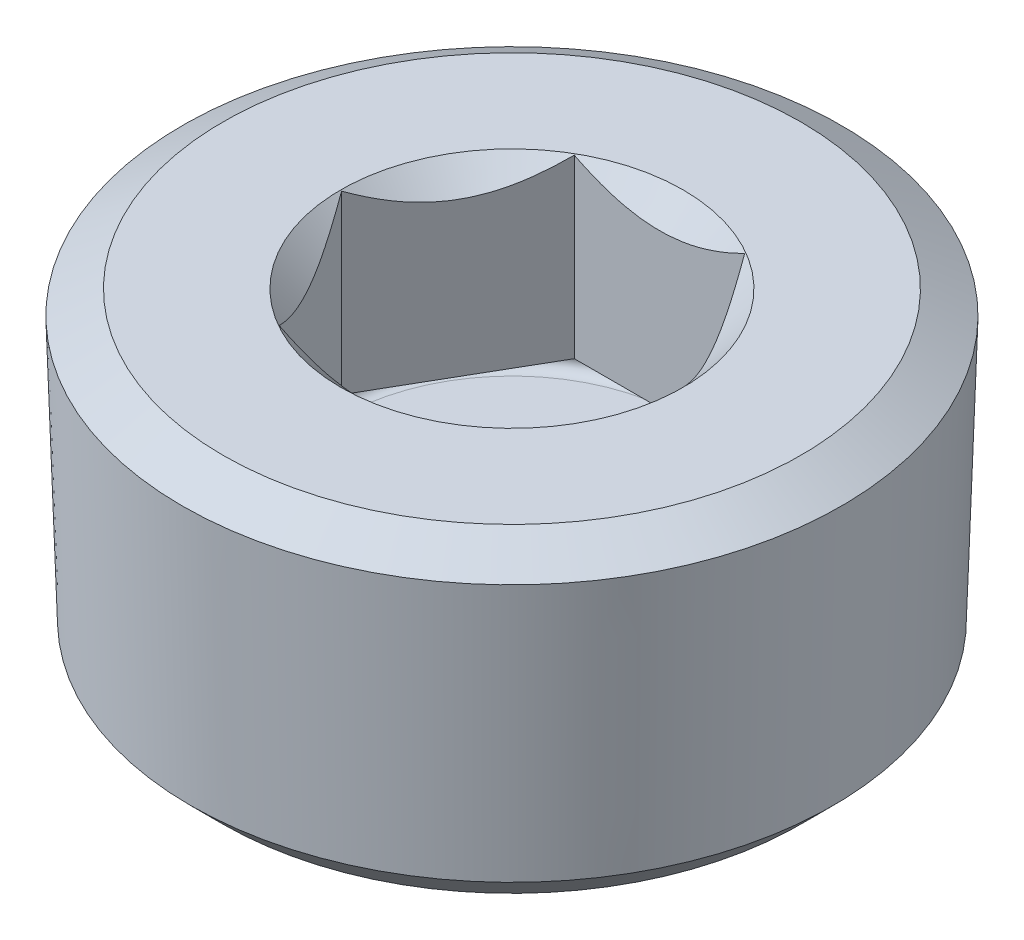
ISO-10303-21;
HEADER;
FILE_DESCRIPTION(('STEP AP214'),'2;1');
FILE_NAME('part.step','',(''),(''),'','','');
FILE_SCHEMA(('AUTOMOTIVE_DESIGN { 1 0 10303 214 1 1 1 1 }'));
ENDSEC;
DATA;
#1=APPLICATION_CONTEXT('core data for automotive mechanical design processes');
#2=APPLICATION_PROTOCOL_DEFINITION('international standard','automotive_design',2000,#1);
#3=PRODUCT_CONTEXT('',#1,'mechanical');
#4=PRODUCT('Part','Part','',(#3));
#5=PRODUCT_RELATED_PRODUCT_CATEGORY('part','',(#4));
#6=PRODUCT_DEFINITION_FORMATION('','',#4);
#7=PRODUCT_DEFINITION_CONTEXT('part definition',#1,'design');
#8=PRODUCT_DEFINITION('design','',#6,#7);
#9=PRODUCT_DEFINITION_SHAPE('','',#8);
#10=(LENGTH_UNIT() NAMED_UNIT(*) SI_UNIT(.MILLI.,.METRE.));
#11=(NAMED_UNIT(*) PLANE_ANGLE_UNIT() SI_UNIT($,.RADIAN.));
#12=(NAMED_UNIT(*) SI_UNIT($,.STERADIAN.) SOLID_ANGLE_UNIT());
#13=UNCERTAINTY_MEASURE_WITH_UNIT(LENGTH_MEASURE(1.E-05),#10,'distance_accuracy_value','');
#14=(GEOMETRIC_REPRESENTATION_CONTEXT(3) GLOBAL_UNCERTAINTY_ASSIGNED_CONTEXT((#13)) GLOBAL_UNIT_ASSIGNED_CONTEXT((#10,
#11,#12)) REPRESENTATION_CONTEXT('',''));
#15=CARTESIAN_POINT('',(0.,0.,0.));
#16=DIRECTION('',(0.,0.,1.));
#17=DIRECTION('',(1.,0.,0.));
#18=AXIS2_PLACEMENT_3D('',#15,#16,#17);
#19=CARTESIAN_POINT('',(0.,0.,0.));
#20=DIRECTION('',(0.,1.,0.));
#21=DIRECTION('',(0.,0.,1.));
#22=AXIS2_PLACEMENT_3D('',#19,#20,#21);
#23=PLANE('',#22);
#24=CARTESIAN_POINT('',(0.,0.,0.));
#25=DIRECTION('',(0.,1.,0.));
#26=DIRECTION('',(0.,0.,1.));
#27=AXIS2_PLACEMENT_3D('',#24,#25,#26);
#28=CIRCLE('',#27,11.049);
#29=CARTESIAN_POINT('',(0.,0.,11.049));
#30=VERTEX_POINT('',#29);
#31=EDGE_CURVE('E210',#30,#30,#28,.T.);
#32=ORIENTED_EDGE('',*,*,#31,.F.);
#33=EDGE_LOOP('',(#32));
#34=FACE_BOUND('',#33,.T.);
#35=CARTESIAN_POINT('',(0.,0.,0.));
#36=DIRECTION('',(0.,1.,0.));
#37=DIRECTION('',(0.,0.,1.));
#38=AXIS2_PLACEMENT_3D('',#35,#36,#37);
#39=CIRCLE('',#38,18.6474634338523);
#40=CARTESIAN_POINT('',(0.,0.,18.6474634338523));
#41=VERTEX_POINT('',#40);
#42=EDGE_CURVE('E96',#41,#41,#39,.T.);
#43=ORIENTED_EDGE('',*,*,#42,.T.);
#44=EDGE_LOOP('',(#43));
#45=FACE_BOUND('',#44,.T.);
#46=ADVANCED_FACE('F34',(#34,#45),#23,.T.);
#47=CARTESIAN_POINT('',(0.,0.,0.));
#48=DIRECTION('',(0.,-1.,0.));
#49=DIRECTION('',(0.,0.,-1.));
#50=AXIS2_PLACEMENT_3D('',#47,#48,#49);
#51=CONICAL_SURFACE('',#50,18.6474634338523,1.0471975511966);
#52=CARTESIAN_POINT('',(0.,-1.51754437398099,0.));
#53=DIRECTION('',(0.,1.,0.));
#54=DIRECTION('',(0.,0.,1.));
#55=AXIS2_PLACEMENT_3D('',#52,#53,#54);
#56=CIRCLE('',#55,21.2759273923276);
#57=CARTESIAN_POINT('',(0.,-1.51754437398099,21.2759273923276));
#58=VERTEX_POINT('',#57);
#59=EDGE_CURVE('E214',#58,#58,#56,.T.);
#60=ORIENTED_EDGE('',*,*,#59,.T.);
#61=EDGE_LOOP('',(#60));
#62=FACE_BOUND('',#61,.T.);
#63=ORIENTED_EDGE('',*,*,#42,.F.);
#64=EDGE_LOOP('',(#63));
#65=FACE_BOUND('',#64,.T.);
#66=ADVANCED_FACE('F200',(#62,#65),#51,.T.);
#67=CARTESIAN_POINT('',(0.,-1.51754437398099,0.));
#68=DIRECTION('',(0.,1.,0.));
#69=DIRECTION('',(0.,0.,1.));
#70=AXIS2_PLACEMENT_3D('',#67,#68,#69);
#71=CONICAL_SURFACE('',#70,21.2759273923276,0.0312064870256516);
#72=CARTESIAN_POINT('',(0.,-18.5273238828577,0.));
#73=DIRECTION('',(0.,1.,0.));
#74=DIRECTION('',(0.,0.,1.));
#75=AXIS2_PLACEMENT_3D('',#72,#73,#74);
#76=CIRCLE('',#75,20.7449395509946);
#77=CARTESIAN_POINT('',(0.,-18.5273238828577,20.7449395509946));
#78=VERTEX_POINT('',#77);
#79=EDGE_CURVE('E217',#78,#78,#76,.T.);
#80=ORIENTED_EDGE('',*,*,#79,.T.);
#81=EDGE_LOOP('',(#80));
#82=FACE_BOUND('',#81,.T.);
#83=ORIENTED_EDGE('',*,*,#59,.F.);
#84=EDGE_LOOP('',(#83));
#85=FACE_BOUND('',#84,.T.);
#86=ADVANCED_FACE('F205',(#82,#85),#71,.T.);
#87=CARTESIAN_POINT('',(0.,-18.5273238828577,0.));
#88=DIRECTION('',(0.,1.,0.));
#89=DIRECTION('',(0.,0.,1.));
#90=AXIS2_PLACEMENT_3D('',#87,#88,#89);
#91=CONICAL_SURFACE('',#90,20.7449395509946,0.785398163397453);
#92=CARTESIAN_POINT('',(0.,-20.6248,0.));
#93=DIRECTION('',(0.,1.,0.));
#94=DIRECTION('',(0.,0.,1.));
#95=AXIS2_PLACEMENT_3D('',#92,#93,#94);
#96=CIRCLE('',#95,18.6474634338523);
#97=CARTESIAN_POINT('',(0.,-20.6248,18.6474634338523));
#98=VERTEX_POINT('',#97);
#99=EDGE_CURVE('E222',#98,#98,#96,.T.);
#100=ORIENTED_EDGE('',*,*,#99,.T.);
#101=EDGE_LOOP('',(#100));
#102=FACE_BOUND('',#101,.T.);
#103=ORIENTED_EDGE('',*,*,#79,.F.);
#104=EDGE_LOOP('',(#103));
#105=FACE_BOUND('',#104,.T.);
#106=ADVANCED_FACE('F305',(#102,#105),#91,.T.);
#107=CARTESIAN_POINT('',(-18.6474634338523,-20.6248,0.));
#108=DIRECTION('',(0.,-1.,0.));
#109=DIRECTION('',(0.,0.,-1.));
#110=AXIS2_PLACEMENT_3D('',#107,#108,#109);
#111=PLANE('',#110);
#112=ORIENTED_EDGE('',*,*,#99,.F.);
#113=EDGE_LOOP('',(#112));
#114=FACE_BOUND('',#113,.T.);
#115=ADVANCED_FACE('F149',(#114),#111,.T.);
#116=CARTESIAN_POINT('',(0.,0.,0.));
#117=DIRECTION('',(0.,1.,0.));
#118=DIRECTION('',(0.,0.,1.));
#119=AXIS2_PLACEMENT_3D('',#116,#117,#118);
#120=CONICAL_SURFACE('',#119,11.049,0.785398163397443);
#121=CARTESIAN_POINT('',(-11.49689211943,3.88097499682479,9.525));
#122=CARTESIAN_POINT('',(-11.2192109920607,3.66719342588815,9.525));
#123=CARTESIAN_POINT('',(-10.9400359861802,3.45532180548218,9.525));
#124=CARTESIAN_POINT('',(-10.3780867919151,3.03627173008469,9.525));
#125=CARTESIAN_POINT('',(-10.0953117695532,2.82909439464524,9.525));
#126=CARTESIAN_POINT('',(-9.5234849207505,2.41883185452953,9.525));
#127=CARTESIAN_POINT('',(-9.23440150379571,2.21579053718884,9.525));
#128=CARTESIAN_POINT('',(-8.65142747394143,1.81675439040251,9.525));
#129=CARTESIAN_POINT('',(-8.35753719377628,1.620759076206,9.525));
#130=CARTESIAN_POINT('',(-7.74525046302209,1.22521931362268,9.525));
#131=CARTESIAN_POINT('',(-7.42648498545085,1.02624324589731,9.525));
#132=CARTESIAN_POINT('',(-6.78146699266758,0.640613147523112,9.525));
#133=CARTESIAN_POINT('',(-6.45521322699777,0.453961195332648,9.525));
#134=CARTESIAN_POINT('',(-5.79512470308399,0.096952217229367,9.525));
#135=CARTESIAN_POINT('',(-5.46131601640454,-0.0734526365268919,9.525));
#136=CARTESIAN_POINT('',(-4.78424953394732,-0.394149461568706,9.525));
#137=CARTESIAN_POINT('',(-4.44099629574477,-0.544450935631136,9.525));
#138=CARTESIAN_POINT('',(-3.77889720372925,-0.805823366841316,9.525));
#139=CARTESIAN_POINT('',(-3.46101405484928,-0.91930823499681,9.525));
#140=CARTESIAN_POINT('',(-2.81713163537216,-1.12083511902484,9.525));
#141=CARTESIAN_POINT('',(-2.49113185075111,-1.20887551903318,9.525));
#142=CARTESIAN_POINT('',(-1.83865140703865,-1.35327332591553,9.525));
#143=CARTESIAN_POINT('',(-1.51230057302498,-1.41020749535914,9.525));
#144=CARTESIAN_POINT('',(-0.855522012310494,-1.49120208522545,9.525));
#145=CARTESIAN_POINT('',(-0.525095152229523,-1.51526937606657,9.525));
#146=CARTESIAN_POINT('',(0.121903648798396,-1.52846981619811,9.525));
#147=CARTESIAN_POINT('',(0.438445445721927,-1.51909358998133,9.525));
#148=CARTESIAN_POINT('',(1.06906801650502,-1.46935129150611,9.525));
#149=CARTESIAN_POINT('',(1.3831485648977,-1.42898241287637,9.525));
#150=CARTESIAN_POINT('',(2.01189915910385,-1.31885442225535,9.525));
#151=CARTESIAN_POINT('',(2.3264766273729,-1.24857566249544,9.525));
#152=CARTESIAN_POINT('',(2.94870072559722,-1.08253292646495,9.525));
#153=CARTESIAN_POINT('',(3.25634774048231,-0.986770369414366,9.525));
#154=CARTESIAN_POINT('',(3.88126120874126,-0.767982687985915,9.525));
#155=CARTESIAN_POINT('',(4.19809084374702,-0.643724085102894,9.525));
#156=CARTESIAN_POINT('',(4.82360317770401,-0.376005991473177,9.525));
#157=CARTESIAN_POINT('',(5.13228213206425,-0.232537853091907,9.525));
#158=CARTESIAN_POINT('',(5.74294917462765,0.0701972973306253,9.525));
#159=CARTESIAN_POINT('',(6.04491295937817,0.229512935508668,9.525));
#160=CARTESIAN_POINT('',(6.64192212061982,0.560437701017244,9.525));
#161=CARTESIAN_POINT('',(6.93696855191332,0.732044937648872,9.525));
#162=CARTESIAN_POINT('',(7.50662944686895,1.07643721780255,9.525));
#163=CARTESIAN_POINT('',(7.78153348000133,1.2487458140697,9.525));
#164=CARTESIAN_POINT('',(8.32661839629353,1.60070008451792,9.525));
#165=CARTESIAN_POINT('',(8.59679892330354,1.78034630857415,9.525));
#166=CARTESIAN_POINT('',(9.13088323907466,2.14420570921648,9.525));
#167=CARTESIAN_POINT('',(9.3948200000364,2.32837066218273,9.525));
#168=CARTESIAN_POINT('',(9.91907224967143,2.70163946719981,9.525));
#169=CARTESIAN_POINT('',(10.1793887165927,2.89074194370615,9.525));
#170=CARTESIAN_POINT('',(10.4381864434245,3.08186555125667,9.525));
#171=B_SPLINE_CURVE_WITH_KNOTS('',3,(#121,#122,#123,#124,#125,#126,#127,#128,#129,#130,#131,
#132,#133,#134,#135,#136,#137,#138,#139,#140,#141,#142,#143,#144,#145,#146,#147,#148,#149,#150,
#151,#152,#153,#154,#155,#156,#157,#158,#159,#160,#161,#162,#163,#164,#165,#166,#167,#168,#169,
#170),.UNSPECIFIED.,.F.,.F.,(4,2,2,2,2,2,2,2,2,2,2,2,2,2,2,2,2,2,2,2,2,2,2,2,4),(0.,
1.05134425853,2.10293667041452,3.16263996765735,4.22227021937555,5.34935795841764,
6.47663529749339,7.60048450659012,8.72380058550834,9.73552741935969,10.7473184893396,
11.7396508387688,12.7317757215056,13.6802435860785,14.6287973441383,15.5945508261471,
16.5602505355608,17.5804442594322,18.6010988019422,19.6249878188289,20.6487196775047,
21.6219085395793,22.5951704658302,23.5606213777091,24.5258061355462),.UNSPECIFIED.);
#172=CARTESIAN_POINT('',(5.49926131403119,-0.0504773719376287,9.525));
#173=VERTEX_POINT('',#172);
#174=CARTESIAN_POINT('',(-5.49926131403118,-0.0504773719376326,9.525));
#175=VERTEX_POINT('',#174);
#176=EDGE_CURVE('E48',#173,#175,#171,.F.);
#177=ORIENTED_EDGE('',*,*,#176,.T.);
#178=CARTESIAN_POINT('',(-5.49914584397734,-0.0503619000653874,9.5252));
#179=CARTESIAN_POINT('',(-5.59369092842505,-0.144893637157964,9.36144311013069));
#180=CARTESIAN_POINT('',(-5.6889764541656,-0.236540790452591,9.19640373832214));
#181=CARTESIAN_POINT('',(-5.88114364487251,-0.413149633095,8.86356040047));
#182=CARTESIAN_POINT('',(-5.97802614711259,-0.498107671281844,8.69575498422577));
#183=CARTESIAN_POINT('',(-6.17395951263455,-0.66078179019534,8.35638844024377));
#184=CARTESIAN_POINT('',(-6.27301961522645,-0.738453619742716,8.18481130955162));
#185=CARTESIAN_POINT('',(-6.47276685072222,-0.88486835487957,7.83883894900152));
#186=CARTESIAN_POINT('',(-6.57345373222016,-0.953612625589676,7.66444415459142));
#187=CARTESIAN_POINT('',(-6.77483563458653,-1.07999715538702,7.31564046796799));
#188=CARTESIAN_POINT('',(-6.87550590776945,-1.13779424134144,7.14127444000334));
#189=CARTESIAN_POINT('',(-7.07825767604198,-1.24243057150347,6.79009807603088));
#190=CARTESIAN_POINT('',(-7.18033901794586,-1.28927099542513,6.61328800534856));
#191=CARTESIAN_POINT('',(-7.38547629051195,-1.37081474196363,6.25797982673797));
#192=CARTESIAN_POINT('',(-7.48852948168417,-1.40554538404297,6.07948646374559));
#193=CARTESIAN_POINT('',(-7.69550102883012,-1.46210640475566,5.72100122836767));
#194=CARTESIAN_POINT('',(-7.79941925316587,-1.48393871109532,5.5410095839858));
#195=CARTESIAN_POINT('',(-8.05265883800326,-1.5205452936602,5.1023857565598));
#196=CARTESIAN_POINT('',(-8.20225391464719,-1.52822719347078,4.84327948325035));
#197=CARTESIAN_POINT('',(-8.50117351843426,-1.51533350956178,4.32553554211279));
#198=CARTESIAN_POINT('',(-8.65049793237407,-1.49474802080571,4.06689807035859));
#199=CARTESIAN_POINT('',(-8.94773915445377,-1.42653463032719,3.55206117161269));
#200=CARTESIAN_POINT('',(-9.09565420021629,-1.37887648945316,3.29586479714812));
#201=CARTESIAN_POINT('',(-9.38894191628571,-1.25910833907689,2.78787557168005));
#202=CARTESIAN_POINT('',(-9.53431478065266,-1.18700020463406,2.53608238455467));
#203=CARTESIAN_POINT('',(-9.79237138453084,-1.03865549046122,2.08911523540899));
#204=CARTESIAN_POINT('',(-9.9056266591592,-0.966321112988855,1.89295134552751));
#205=CARTESIAN_POINT('',(-10.1301042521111,-0.809996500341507,1.504144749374));
#206=CARTESIAN_POINT('',(-10.2413265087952,-0.726005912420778,1.31150214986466));
#207=CARTESIAN_POINT('',(-10.4613877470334,-0.548251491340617,0.930344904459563));
#208=CARTESIAN_POINT('',(-10.5702329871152,-0.454518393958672,0.74181941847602));
#209=CARTESIAN_POINT('',(-10.7859080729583,-0.258509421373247,0.368259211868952));
#210=CARTESIAN_POINT('',(-10.8927391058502,-0.156238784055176,0.183222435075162));
#211=CARTESIAN_POINT('',(-10.9986380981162,-0.0503619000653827,-0.000199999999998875));
#212=B_SPLINE_CURVE_WITH_KNOTS('',3,(#178,#179,#180,#181,#182,#183,#184,#185,#186,#187,#188,
#189,#190,#191,#192,#193,#194,#195,#196,#197,#198,#199,#200,#201,#202,#203,#204,#205,#206,#207,
#208,#209,#210,#211),.UNSPECIFIED.,.F.,.F.,(4,2,2,2,2,2,2,2,2,2,2,2,2,2,2,2,4),(0.,
0.634236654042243,1.26881713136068,1.9070310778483,2.54514731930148,3.17328515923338,
3.80135533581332,4.42799928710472,5.0545495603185,5.95101645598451,6.84779755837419,
7.74558230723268,8.64329822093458,9.35630333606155,10.0693300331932,10.7801718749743,
11.4905807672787),.UNSPECIFIED.);
#213=CARTESIAN_POINT('',(-10.9985226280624,-0.0504773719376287,0.));
#214=VERTEX_POINT('',#213);
#215=EDGE_CURVE('E102',#175,#214,#212,.T.);
#216=ORIENTED_EDGE('',*,*,#215,.T.);
#217=CARTESIAN_POINT('',(-10.9986380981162,-0.0503619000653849,0.000200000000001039));
#218=CARTESIAN_POINT('',(-10.9040930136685,-0.144893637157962,-0.16355688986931));
#219=CARTESIAN_POINT('',(-10.808807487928,-0.236540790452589,-0.328596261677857));
#220=CARTESIAN_POINT('',(-10.616640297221,-0.413149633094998,-0.661439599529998));
#221=CARTESIAN_POINT('',(-10.519757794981,-0.498107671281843,-0.829245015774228));
#222=CARTESIAN_POINT('',(-10.323824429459,-0.660781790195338,-1.16861155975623));
#223=CARTESIAN_POINT('',(-10.2247643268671,-0.738453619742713,-1.34018869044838));
#224=CARTESIAN_POINT('',(-10.0250170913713,-0.884868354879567,-1.68616105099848));
#225=CARTESIAN_POINT('',(-9.92433020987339,-0.953612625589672,-1.86055584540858));
#226=CARTESIAN_POINT('',(-9.72294830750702,-1.07999715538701,-2.20935953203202));
#227=CARTESIAN_POINT('',(-9.62227803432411,-1.13779424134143,-2.38372555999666));
#228=CARTESIAN_POINT('',(-9.41952626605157,-1.24243057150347,-2.73490192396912));
#229=CARTESIAN_POINT('',(-9.3174449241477,-1.28927099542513,-2.91171199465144));
#230=CARTESIAN_POINT('',(-9.1123076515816,-1.37081474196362,-3.26702017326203));
#231=CARTESIAN_POINT('',(-9.00925446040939,-1.40554538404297,-3.44551353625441));
#232=CARTESIAN_POINT('',(-8.80228291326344,-1.46210640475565,-3.80399877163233));
#233=CARTESIAN_POINT('',(-8.69836468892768,-1.48393871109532,-3.98399041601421));
#234=CARTESIAN_POINT('',(-8.4451251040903,-1.52054529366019,-4.42261424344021));
#235=CARTESIAN_POINT('',(-8.29553002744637,-1.52822719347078,-4.68172051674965));
#236=CARTESIAN_POINT('',(-7.9966104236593,-1.51533350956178,-5.19946445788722));
#237=CARTESIAN_POINT('',(-7.84728600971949,-1.4947480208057,-5.45810192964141));
#238=CARTESIAN_POINT('',(-7.55004478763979,-1.42653463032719,-5.97293882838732));
#239=CARTESIAN_POINT('',(-7.40212974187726,-1.37887648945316,-6.22913520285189));
#240=CARTESIAN_POINT('',(-7.10884202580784,-1.25910833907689,-6.73712442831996));
#241=CARTESIAN_POINT('',(-6.96346916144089,-1.18700020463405,-6.98891761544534));
#242=CARTESIAN_POINT('',(-6.70541255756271,-1.03865549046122,-7.43588476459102));
#243=CARTESIAN_POINT('',(-6.59215728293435,-0.966321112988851,-7.6320486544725));
#244=CARTESIAN_POINT('',(-6.36767968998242,-0.809996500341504,-8.02085525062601));
#245=CARTESIAN_POINT('',(-6.25645743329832,-0.726005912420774,-8.21349785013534));
#246=CARTESIAN_POINT('',(-6.03639619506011,-0.548251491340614,-8.59465509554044));
#247=CARTESIAN_POINT('',(-5.92755095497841,-0.454518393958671,-8.78318058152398));
#248=CARTESIAN_POINT('',(-5.71187586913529,-0.258509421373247,-9.15674078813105));
#249=CARTESIAN_POINT('',(-5.60504483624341,-0.156238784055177,-9.34177756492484));
#250=CARTESIAN_POINT('',(-5.49914584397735,-0.0503619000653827,-9.5252));
#251=B_SPLINE_CURVE_WITH_KNOTS('',3,(#217,#218,#219,#220,#221,#222,#223,#224,#225,#226,#227,
#228,#229,#230,#231,#232,#233,#234,#235,#236,#237,#238,#239,#240,#241,#242,#243,#244,#245,#246,
#247,#248,#249,#250),.UNSPECIFIED.,.F.,.F.,(4,2,2,2,2,2,2,2,2,2,2,2,2,2,2,2,4),(0.,
0.634236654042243,1.26881713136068,1.9070310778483,2.54514731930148,3.17328515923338,
3.80135533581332,4.42799928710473,5.0545495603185,5.95101645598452,6.84779755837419,
7.74558230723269,8.64329822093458,9.35630333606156,10.0693300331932,10.7801718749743,
11.4905807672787),.UNSPECIFIED.);
#252=CARTESIAN_POINT('',(-5.49926131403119,-0.0504773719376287,-9.525));
#253=VERTEX_POINT('',#252);
#254=EDGE_CURVE('E172',#214,#253,#251,.T.);
#255=ORIENTED_EDGE('',*,*,#254,.T.);
#256=CARTESIAN_POINT('',(-11.49689211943,3.8809749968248,-9.525));
#257=CARTESIAN_POINT('',(-11.2192109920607,3.66719342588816,-9.525));
#258=CARTESIAN_POINT('',(-10.9400359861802,3.45532180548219,-9.525));
#259=CARTESIAN_POINT('',(-10.3780867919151,3.0362717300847,-9.525));
#260=CARTESIAN_POINT('',(-10.0953117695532,2.82909439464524,-9.525));
#261=CARTESIAN_POINT('',(-9.52348492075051,2.41883185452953,-9.525));
#262=CARTESIAN_POINT('',(-9.23440150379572,2.21579053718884,-9.525));
#263=CARTESIAN_POINT('',(-8.65142747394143,1.81675439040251,-9.525));
#264=CARTESIAN_POINT('',(-8.35753719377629,1.620759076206,-9.525));
#265=CARTESIAN_POINT('',(-7.7452504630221,1.22521931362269,-9.525));
#266=CARTESIAN_POINT('',(-7.42648498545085,1.02624324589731,-9.525));
#267=CARTESIAN_POINT('',(-6.78146699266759,0.640613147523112,-9.525));
#268=CARTESIAN_POINT('',(-6.45521322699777,0.453961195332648,-9.525));
#269=CARTESIAN_POINT('',(-5.79512470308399,0.0969522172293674,-9.525));
#270=CARTESIAN_POINT('',(-5.46131601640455,-0.0734526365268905,-9.525));
#271=CARTESIAN_POINT('',(-4.78424953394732,-0.394149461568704,-9.525));
#272=CARTESIAN_POINT('',(-4.44099629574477,-0.544450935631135,-9.525));
#273=CARTESIAN_POINT('',(-3.77889720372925,-0.805823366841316,-9.525));
#274=CARTESIAN_POINT('',(-3.46101405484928,-0.919308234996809,-9.525));
#275=CARTESIAN_POINT('',(-2.81713163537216,-1.12083511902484,-9.525));
#276=CARTESIAN_POINT('',(-2.49113185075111,-1.20887551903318,-9.525));
#277=CARTESIAN_POINT('',(-1.83865140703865,-1.35327332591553,-9.525));
#278=CARTESIAN_POINT('',(-1.51230057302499,-1.41020749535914,-9.525));
#279=CARTESIAN_POINT('',(-0.855522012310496,-1.49120208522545,-9.525));
#280=CARTESIAN_POINT('',(-0.525095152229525,-1.51526937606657,-9.525));
#281=CARTESIAN_POINT('',(0.121903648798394,-1.52846981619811,-9.525));
#282=CARTESIAN_POINT('',(0.438445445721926,-1.51909358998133,-9.525));
#283=CARTESIAN_POINT('',(1.06906801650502,-1.46935129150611,-9.525));
#284=CARTESIAN_POINT('',(1.3831485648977,-1.42898241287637,-9.525));
#285=CARTESIAN_POINT('',(2.01189915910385,-1.31885442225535,-9.525));
#286=CARTESIAN_POINT('',(2.3264766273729,-1.24857566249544,-9.525));
#287=CARTESIAN_POINT('',(2.94870072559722,-1.08253292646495,-9.525));
#288=CARTESIAN_POINT('',(3.25634774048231,-0.986770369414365,-9.525));
#289=CARTESIAN_POINT('',(3.88126120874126,-0.767982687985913,-9.525));
#290=CARTESIAN_POINT('',(4.19809084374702,-0.643724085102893,-9.525));
#291=CARTESIAN_POINT('',(4.823603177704,-0.376005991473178,-9.525));
#292=CARTESIAN_POINT('',(5.13228213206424,-0.232537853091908,-9.525));
#293=CARTESIAN_POINT('',(5.74294917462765,0.0701972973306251,-9.525));
#294=CARTESIAN_POINT('',(6.04491295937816,0.229512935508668,-9.525));
#295=CARTESIAN_POINT('',(6.64192212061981,0.560437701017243,-9.525));
#296=CARTESIAN_POINT('',(6.93696855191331,0.73204493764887,-9.525));
#297=CARTESIAN_POINT('',(7.50662944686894,1.07643721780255,-9.525));
#298=CARTESIAN_POINT('',(7.78153348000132,1.24874581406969,-9.525));
#299=CARTESIAN_POINT('',(8.32661839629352,1.60070008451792,-9.525));
#300=CARTESIAN_POINT('',(8.59679892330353,1.78034630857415,-9.525));
#301=CARTESIAN_POINT('',(9.13088323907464,2.14420570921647,-9.525));
#302=CARTESIAN_POINT('',(9.39482000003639,2.32837066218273,-9.525));
#303=CARTESIAN_POINT('',(9.91907224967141,2.7016394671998,-9.525));
#304=CARTESIAN_POINT('',(10.1793887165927,2.89074194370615,-9.525));
#305=CARTESIAN_POINT('',(10.4381864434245,3.08186555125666,-9.525));
#306=B_SPLINE_CURVE_WITH_KNOTS('',3,(#256,#257,#258,#259,#260,#261,#262,#263,#264,#265,#266,
#267,#268,#269,#270,#271,#272,#273,#274,#275,#276,#277,#278,#279,#280,#281,#282,#283,#284,#285,
#286,#287,#288,#289,#290,#291,#292,#293,#294,#295,#296,#297,#298,#299,#300,#301,#302,#303,#304,
#305),.UNSPECIFIED.,.F.,.F.,(4,2,2,2,2,2,2,2,2,2,2,2,2,2,2,2,2,2,2,2,2,2,2,2,4),(0.,
1.05134425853,2.10293667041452,3.16263996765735,4.22227021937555,5.34935795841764,
6.4766352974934,7.60048450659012,8.72380058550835,9.7355274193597,10.7473184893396,
11.7396508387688,12.7317757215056,13.6802435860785,14.6287973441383,15.5945508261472,
16.5602505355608,17.5804442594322,18.6010988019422,19.6249878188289,20.6487196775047,
21.6219085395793,22.5951704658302,23.5606213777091,24.5258061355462),.UNSPECIFIED.);
#307=CARTESIAN_POINT('',(5.49926131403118,-0.0504773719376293,-9.525));
#308=VERTEX_POINT('',#307);
#309=EDGE_CURVE('E165',#253,#308,#306,.T.);
#310=ORIENTED_EDGE('',*,*,#309,.T.);
#311=CARTESIAN_POINT('',(5.49914584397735,-0.0503619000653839,-9.5252));
#312=CARTESIAN_POINT('',(5.59369092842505,-0.144893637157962,-9.36144311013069));
#313=CARTESIAN_POINT('',(5.6889764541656,-0.236540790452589,-9.19640373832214));
#314=CARTESIAN_POINT('',(5.88114364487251,-0.413149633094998,-8.86356040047));
#315=CARTESIAN_POINT('',(5.97802614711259,-0.498107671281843,-8.69575498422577));
#316=CARTESIAN_POINT('',(6.17395951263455,-0.660781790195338,-8.35638844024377));
#317=CARTESIAN_POINT('',(6.27301961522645,-0.738453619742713,-8.18481130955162));
#318=CARTESIAN_POINT('',(6.47276685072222,-0.884868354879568,-7.83883894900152));
#319=CARTESIAN_POINT('',(6.57345373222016,-0.953612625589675,-7.66444415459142));
#320=CARTESIAN_POINT('',(6.77483563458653,-1.07999715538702,-7.31564046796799));
#321=CARTESIAN_POINT('',(6.87550590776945,-1.13779424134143,-7.14127444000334));
#322=CARTESIAN_POINT('',(7.07825767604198,-1.24243057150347,-6.79009807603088));
#323=CARTESIAN_POINT('',(7.18033901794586,-1.28927099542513,-6.61328800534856));
#324=CARTESIAN_POINT('',(7.38547629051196,-1.37081474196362,-6.25797982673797));
#325=CARTESIAN_POINT('',(7.48852948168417,-1.40554538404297,-6.07948646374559));
#326=CARTESIAN_POINT('',(7.69550102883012,-1.46210640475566,-5.72100122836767));
#327=CARTESIAN_POINT('',(7.79941925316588,-1.48393871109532,-5.5410095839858));
#328=CARTESIAN_POINT('',(8.05265883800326,-1.52054529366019,-5.1023857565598));
#329=CARTESIAN_POINT('',(8.20225391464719,-1.52822719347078,-4.84327948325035));
#330=CARTESIAN_POINT('',(8.50117351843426,-1.51533350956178,-4.32553554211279));
#331=CARTESIAN_POINT('',(8.65049793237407,-1.4947480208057,-4.06689807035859));
#332=CARTESIAN_POINT('',(8.94773915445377,-1.42653463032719,-3.55206117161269));
#333=CARTESIAN_POINT('',(9.09565420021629,-1.37887648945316,-3.29586479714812));
#334=CARTESIAN_POINT('',(9.38894191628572,-1.25910833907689,-2.78787557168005));
#335=CARTESIAN_POINT('',(9.53431478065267,-1.18700020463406,-2.53608238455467));
#336=CARTESIAN_POINT('',(9.79237138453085,-1.03865549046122,-2.08911523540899));
#337=CARTESIAN_POINT('',(9.9056266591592,-0.966321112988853,-1.8929513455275));
#338=CARTESIAN_POINT('',(10.1301042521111,-0.809996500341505,-1.50414474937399));
#339=CARTESIAN_POINT('',(10.2413265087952,-0.726005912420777,-1.31150214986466));
#340=CARTESIAN_POINT('',(10.4613877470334,-0.548251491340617,-0.930344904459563));
#341=CARTESIAN_POINT('',(10.5702329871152,-0.454518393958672,-0.741819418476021));
#342=CARTESIAN_POINT('',(10.7859080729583,-0.258509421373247,-0.368259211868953));
#343=CARTESIAN_POINT('',(10.8927391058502,-0.156238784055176,-0.183222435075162));
#344=CARTESIAN_POINT('',(10.9986380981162,-0.0503619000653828,0.00019999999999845));
#345=B_SPLINE_CURVE_WITH_KNOTS('',3,(#311,#312,#313,#314,#315,#316,#317,#318,#319,#320,#321,
#322,#323,#324,#325,#326,#327,#328,#329,#330,#331,#332,#333,#334,#335,#336,#337,#338,#339,#340,
#341,#342,#343,#344),.UNSPECIFIED.,.F.,.F.,(4,2,2,2,2,2,2,2,2,2,2,2,2,2,2,2,4),(0.,
0.634236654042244,1.26881713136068,1.9070310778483,2.54514731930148,3.17328515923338,
3.80135533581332,4.42799928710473,5.0545495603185,5.95101645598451,6.84779755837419,
7.74558230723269,8.64329822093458,9.35630333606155,10.0693300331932,10.7801718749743,
11.4905807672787),.UNSPECIFIED.);
#346=CARTESIAN_POINT('',(10.9985226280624,-0.0504773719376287,0.));
#347=VERTEX_POINT('',#346);
#348=EDGE_CURVE('E158',#308,#347,#345,.T.);
#349=ORIENTED_EDGE('',*,*,#348,.T.);
#350=CARTESIAN_POINT('',(10.9986380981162,-0.0503619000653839,-0.000200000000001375));
#351=CARTESIAN_POINT('',(10.9040930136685,-0.144893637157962,0.163556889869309));
#352=CARTESIAN_POINT('',(10.808807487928,-0.236540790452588,0.328596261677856));
#353=CARTESIAN_POINT('',(10.616640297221,-0.413149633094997,0.661439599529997));
#354=CARTESIAN_POINT('',(10.519757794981,-0.498107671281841,0.829245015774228));
#355=CARTESIAN_POINT('',(10.323824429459,-0.660781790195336,1.16861155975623));
#356=CARTESIAN_POINT('',(10.2247643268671,-0.738453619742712,1.34018869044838));
#357=CARTESIAN_POINT('',(10.0250170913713,-0.884868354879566,1.68616105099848));
#358=CARTESIAN_POINT('',(9.92433020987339,-0.953612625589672,1.86055584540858));
#359=CARTESIAN_POINT('',(9.72294830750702,-1.07999715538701,2.20935953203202));
#360=CARTESIAN_POINT('',(9.62227803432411,-1.13779424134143,2.38372555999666));
#361=CARTESIAN_POINT('',(9.41952626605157,-1.24243057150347,2.73490192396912));
#362=CARTESIAN_POINT('',(9.3174449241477,-1.28927099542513,2.91171199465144));
#363=CARTESIAN_POINT('',(9.1123076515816,-1.37081474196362,3.26702017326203));
#364=CARTESIAN_POINT('',(9.00925446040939,-1.40554538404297,3.44551353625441));
#365=CARTESIAN_POINT('',(8.80228291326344,-1.46210640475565,3.80399877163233));
#366=CARTESIAN_POINT('',(8.69836468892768,-1.48393871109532,3.98399041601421));
#367=CARTESIAN_POINT('',(8.4451251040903,-1.5205452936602,4.42261424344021));
#368=CARTESIAN_POINT('',(8.29553002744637,-1.52822719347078,4.68172051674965));
#369=CARTESIAN_POINT('',(7.9966104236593,-1.51533350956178,5.19946445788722));
#370=CARTESIAN_POINT('',(7.84728600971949,-1.4947480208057,5.45810192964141));
#371=CARTESIAN_POINT('',(7.55004478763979,-1.42653463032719,5.97293882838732));
#372=CARTESIAN_POINT('',(7.40212974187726,-1.37887648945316,6.22913520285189));
#373=CARTESIAN_POINT('',(7.10884202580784,-1.25910833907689,6.73712442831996));
#374=CARTESIAN_POINT('',(6.96346916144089,-1.18700020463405,6.98891761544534));
#375=CARTESIAN_POINT('',(6.70541255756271,-1.03865549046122,7.43588476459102));
#376=CARTESIAN_POINT('',(6.59215728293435,-0.966321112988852,7.6320486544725));
#377=CARTESIAN_POINT('',(6.36767968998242,-0.809996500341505,8.02085525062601));
#378=CARTESIAN_POINT('',(6.25645743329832,-0.726005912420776,8.21349785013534));
#379=CARTESIAN_POINT('',(6.03639619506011,-0.548251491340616,8.59465509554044));
#380=CARTESIAN_POINT('',(5.92755095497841,-0.454518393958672,8.78318058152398));
#381=CARTESIAN_POINT('',(5.71187586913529,-0.258509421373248,9.15674078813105));
#382=CARTESIAN_POINT('',(5.60504483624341,-0.156238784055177,9.34177756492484));
#383=CARTESIAN_POINT('',(5.49914584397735,-0.0503619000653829,9.5252));
#384=B_SPLINE_CURVE_WITH_KNOTS('',3,(#350,#351,#352,#353,#354,#355,#356,#357,#358,#359,#360,
#361,#362,#363,#364,#365,#366,#367,#368,#369,#370,#371,#372,#373,#374,#375,#376,#377,#378,#379,
#380,#381,#382,#383),.UNSPECIFIED.,.F.,.F.,(4,2,2,2,2,2,2,2,2,2,2,2,2,2,2,2,4),(0.,
0.634236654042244,1.26881713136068,1.9070310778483,2.54514731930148,3.17328515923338,
3.80135533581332,4.42799928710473,5.0545495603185,5.95101645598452,6.84779755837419,
7.74558230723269,8.64329822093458,9.35630333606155,10.0693300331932,10.7801718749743,
11.4905807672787),.UNSPECIFIED.);
#385=EDGE_CURVE('E121',#347,#173,#384,.T.);
#386=ORIENTED_EDGE('',*,*,#385,.T.);
#387=EDGE_LOOP('',(#177,#216,#255,#310,#349,#386));
#388=FACE_BOUND('',#387,.T.);
#389=ORIENTED_EDGE('',*,*,#31,.T.);
#390=EDGE_LOOP('',(#389));
#391=FACE_BOUND('',#390,.T.);
#392=ADVANCED_FACE('F144',(#388,#391),#120,.F.);
#393=CARTESIAN_POINT('',(-10.9985226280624,-11.43,0.));
#394=DIRECTION('',(-0.866025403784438,0.,0.5));
#395=DIRECTION('',(0.5,0.,0.866025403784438));
#396=AXIS2_PLACEMENT_3D('',#393,#394,#395);
#397=PLANE('',#396);
#398=DIRECTION('',(0.,1.,0.));
#399=VECTOR('',#398,1.);
#400=CARTESIAN_POINT('',(-5.49926131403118,-11.43,9.525));
#401=LINE('',#400,#399);
#402=CARTESIAN_POINT('',(-5.49926131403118,-11.43,9.525));
#403=VERTEX_POINT('',#402);
#404=EDGE_CURVE('E90',#403,#175,#401,.T.);
#405=ORIENTED_EDGE('',*,*,#404,.F.);
#406=DIRECTION('',(0.5,0.,0.866025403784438));
#407=VECTOR('',#406,1.);
#408=CARTESIAN_POINT('',(-10.6301419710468,-11.43,0.638054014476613));
#409=LINE('',#408,#407);
#410=CARTESIAN_POINT('',(-10.9985226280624,-11.43,0.));
#411=VERTEX_POINT('',#410);
#412=EDGE_CURVE('E95',#411,#403,#409,.T.);
#413=ORIENTED_EDGE('',*,*,#412,.F.);
#414=DIRECTION('',(0.,1.,0.));
#415=VECTOR('',#414,1.);
#416=CARTESIAN_POINT('',(-10.9985226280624,-11.43,0.));
#417=LINE('',#416,#415);
#418=EDGE_CURVE('E135',#411,#214,#417,.T.);
#419=ORIENTED_EDGE('',*,*,#418,.T.);
#420=ORIENTED_EDGE('',*,*,#215,.F.);
#421=EDGE_LOOP('',(#405,#413,#419,#420));
#422=FACE_BOUND('',#421,.T.);
#423=ADVANCED_FACE('F99',(#422),#397,.F.);
#424=CARTESIAN_POINT('',(-5.49926131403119,-11.43,-9.525));
#425=DIRECTION('',(-0.866025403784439,0.,-0.5));
#426=DIRECTION('',(-0.5,0.,0.866025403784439));
#427=AXIS2_PLACEMENT_3D('',#424,#425,#426);
#428=PLANE('',#427);
#429=ORIENTED_EDGE('',*,*,#418,.F.);
#430=DIRECTION('',(-0.5,0.,0.866025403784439));
#431=VECTOR('',#430,1.);
#432=CARTESIAN_POINT('',(-10.6301419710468,-11.43,-0.638054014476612));
#433=LINE('',#432,#431);
#434=CARTESIAN_POINT('',(-5.49926131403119,-11.43,-9.525));
#435=VERTEX_POINT('',#434);
#436=EDGE_CURVE('E107',#435,#411,#433,.T.);
#437=ORIENTED_EDGE('',*,*,#436,.F.);
#438=DIRECTION('',(0.,1.,0.));
#439=VECTOR('',#438,1.);
#440=CARTESIAN_POINT('',(-5.49926131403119,-11.43,-9.525));
#441=LINE('',#440,#439);
#442=EDGE_CURVE('E123',#435,#253,#441,.T.);
#443=ORIENTED_EDGE('',*,*,#442,.T.);
#444=ORIENTED_EDGE('',*,*,#254,.F.);
#445=EDGE_LOOP('',(#429,#437,#443,#444));
#446=FACE_BOUND('',#445,.T.);
#447=ADVANCED_FACE('F183',(#446),#428,.F.);
#448=CARTESIAN_POINT('',(5.49926131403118,-11.43,-9.525));
#449=DIRECTION('',(0.,0.,-1.));
#450=DIRECTION('',(-1.,0.,0.));
#451=AXIS2_PLACEMENT_3D('',#448,#449,#450);
#452=PLANE('',#451);
#453=ORIENTED_EDGE('',*,*,#442,.F.);
#454=DIRECTION('',(-1.,0.,0.));
#455=VECTOR('',#454,1.);
#456=CARTESIAN_POINT('',(-9.525,-11.43,-9.525));
#457=LINE('',#456,#455);
#458=CARTESIAN_POINT('',(5.49926131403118,-11.43,-9.525));
#459=VERTEX_POINT('',#458);
#460=EDGE_CURVE('E12',#459,#435,#457,.T.);
#461=ORIENTED_EDGE('',*,*,#460,.F.);
#462=DIRECTION('',(0.,1.,0.));
#463=VECTOR('',#462,1.);
#464=CARTESIAN_POINT('',(5.49926131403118,-11.43,-9.525));
#465=LINE('',#464,#463);
#466=EDGE_CURVE('E118',#459,#308,#465,.T.);
#467=ORIENTED_EDGE('',*,*,#466,.T.);
#468=ORIENTED_EDGE('',*,*,#309,.F.);
#469=EDGE_LOOP('',(#453,#461,#467,#468));
#470=FACE_BOUND('',#469,.T.);
#471=ADVANCED_FACE('F186',(#470),#452,.F.);
#472=CARTESIAN_POINT('',(10.9985226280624,-11.43,0.));
#473=DIRECTION('',(0.866025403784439,0.,-0.5));
#474=DIRECTION('',(-0.5,0.,-0.866025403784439));
#475=AXIS2_PLACEMENT_3D('',#472,#473,#474);
#476=PLANE('',#475);
#477=ORIENTED_EDGE('',*,*,#466,.F.);
#478=DIRECTION('',(-0.5,0.,-0.866025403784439));
#479=VECTOR('',#478,1.);
#480=CARTESIAN_POINT('',(5.86764197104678,-11.43,-8.88694598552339));
#481=LINE('',#480,#479);
#482=CARTESIAN_POINT('',(10.9985226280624,-11.43,0.));
#483=VERTEX_POINT('',#482);
#484=EDGE_CURVE('E41',#483,#459,#481,.T.);
#485=ORIENTED_EDGE('',*,*,#484,.F.);
#486=DIRECTION('',(0.,1.,0.));
#487=VECTOR('',#486,1.);
#488=CARTESIAN_POINT('',(10.9985226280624,-11.43,0.));
#489=LINE('',#488,#487);
#490=EDGE_CURVE('E116',#483,#347,#489,.T.);
#491=ORIENTED_EDGE('',*,*,#490,.T.);
#492=ORIENTED_EDGE('',*,*,#348,.F.);
#493=EDGE_LOOP('',(#477,#485,#491,#492));
#494=FACE_BOUND('',#493,.T.);
#495=ADVANCED_FACE('F114',(#494),#476,.F.);
#496=CARTESIAN_POINT('',(5.49926131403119,-11.43,9.525));
#497=DIRECTION('',(0.866025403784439,0.,0.5));
#498=DIRECTION('',(0.5,0.,-0.866025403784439));
#499=AXIS2_PLACEMENT_3D('',#496,#497,#498);
#500=PLANE('',#499);
#501=ORIENTED_EDGE('',*,*,#490,.F.);
#502=DIRECTION('',(0.5,0.,-0.866025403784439));
#503=VECTOR('',#502,1.);
#504=CARTESIAN_POINT('',(5.86764197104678,-11.43,8.88694598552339));
#505=LINE('',#504,#503);
#506=CARTESIAN_POINT('',(5.49926131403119,-11.43,9.525));
#507=VERTEX_POINT('',#506);
#508=EDGE_CURVE('E56',#507,#483,#505,.T.);
#509=ORIENTED_EDGE('',*,*,#508,.F.);
#510=DIRECTION('',(0.,1.,0.));
#511=VECTOR('',#510,1.);
#512=CARTESIAN_POINT('',(5.49926131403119,-11.43,9.525));
#513=LINE('',#512,#511);
#514=EDGE_CURVE('E92',#507,#173,#513,.T.);
#515=ORIENTED_EDGE('',*,*,#514,.T.);
#516=ORIENTED_EDGE('',*,*,#385,.F.);
#517=EDGE_LOOP('',(#501,#509,#515,#516));
#518=FACE_BOUND('',#517,.T.);
#519=ADVANCED_FACE('F120',(#518),#500,.F.);
#520=CARTESIAN_POINT('',(-5.49926131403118,-11.43,9.525));
#521=DIRECTION('',(0.,0.,1.));
#522=DIRECTION('',(1.,0.,0.));
#523=AXIS2_PLACEMENT_3D('',#520,#521,#522);
#524=PLANE('',#523);
#525=ORIENTED_EDGE('',*,*,#514,.F.);
#526=DIRECTION('',(1.,0.,0.));
#527=VECTOR('',#526,1.);
#528=CARTESIAN_POINT('',(-9.525,-11.43,9.525));
#529=LINE('',#528,#527);
#530=EDGE_CURVE('E87',#403,#507,#529,.T.);
#531=ORIENTED_EDGE('',*,*,#530,.F.);
#532=ORIENTED_EDGE('',*,*,#404,.T.);
#533=ORIENTED_EDGE('',*,*,#176,.F.);
#534=EDGE_LOOP('',(#525,#531,#532,#533));
#535=FACE_BOUND('',#534,.T.);
#536=ADVANCED_FACE('F89',(#535),#524,.F.);
#537=CARTESIAN_POINT('',(-11.049,-12.7,0.));
#538=DIRECTION('',(0.,-1.,0.));
#539=DIRECTION('',(0.,0.,-1.));
#540=AXIS2_PLACEMENT_3D('',#537,#538,#539);
#541=PLANE('',#540);
#542=CARTESIAN_POINT('',(0.,-12.7,0.));
#543=DIRECTION('',(0.,1.,0.));
#544=DIRECTION('',(0.,0.,1.));
#545=AXIS2_PLACEMENT_3D('',#542,#543,#544);
#546=CIRCLE('',#545,11.049);
#547=CARTESIAN_POINT('',(0.,-12.7,11.049));
#548=VERTEX_POINT('',#547);
#549=EDGE_CURVE('E228',#548,#548,#546,.T.);
#550=ORIENTED_EDGE('',*,*,#549,.T.);
#551=EDGE_LOOP('',(#550));
#552=FACE_BOUND('',#551,.T.);
#553=ADVANCED_FACE('F198',(#552),#541,.F.);
#554=CARTESIAN_POINT('',(0.,-12.065,0.));
#555=DIRECTION('',(0.,1.,0.));
#556=DIRECTION('',(0.,0.,1.));
#557=AXIS2_PLACEMENT_3D('',#554,#555,#556);
#558=TOROIDAL_SURFACE('',#557,11.049,0.634999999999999);
#559=ORIENTED_EDGE('',*,*,#549,.F.);
#560=EDGE_LOOP('',(#559));
#561=FACE_BOUND('',#560,.T.);
#562=CARTESIAN_POINT('',(0.,-11.43,0.));
#563=DIRECTION('',(0.,1.,0.));
#564=DIRECTION('',(0.,0.,1.));
#565=AXIS2_PLACEMENT_3D('',#562,#563,#564);
#566=CIRCLE('',#565,11.049);
#567=CARTESIAN_POINT('',(0.,-11.43,11.049));
#568=VERTEX_POINT('',#567);
#569=EDGE_CURVE('E226',#568,#568,#566,.T.);
#570=ORIENTED_EDGE('',*,*,#569,.T.);
#571=EDGE_LOOP('',(#570));
#572=FACE_BOUND('',#571,.T.);
#573=ADVANCED_FACE('F239',(#561,#572),#558,.F.);
#574=CARTESIAN_POINT('',(-9.525,-11.43,0.));
#575=DIRECTION('',(0.,1.,0.));
#576=DIRECTION('',(0.,0.,1.));
#577=AXIS2_PLACEMENT_3D('',#574,#575,#576);
#578=PLANE('',#577);
#579=ORIENTED_EDGE('',*,*,#569,.F.);
#580=EDGE_LOOP('',(#579));
#581=FACE_BOUND('',#580,.T.);
#582=ORIENTED_EDGE('',*,*,#484,.T.);
#583=ORIENTED_EDGE('',*,*,#460,.T.);
#584=ORIENTED_EDGE('',*,*,#436,.T.);
#585=ORIENTED_EDGE('',*,*,#412,.T.);
#586=ORIENTED_EDGE('',*,*,#530,.T.);
#587=ORIENTED_EDGE('',*,*,#508,.T.);
#588=EDGE_LOOP('',(#582,#583,#584,#585,#586,#587));
#589=FACE_BOUND('',#588,.T.);
#590=ADVANCED_FACE('F106',(#581,#589),#578,.F.);
#591=CLOSED_SHELL('',(#46,#66,#86,#106,#115,#392,#423,#447,#471,#495,#519,#536,#553,#573,#590));
#592=MANIFOLD_SOLID_BREP('B2',#591);
#593=ADVANCED_BREP_SHAPE_REPRESENTATION('',(#18,#592),#14);
#594=SHAPE_DEFINITION_REPRESENTATION(#9,#593);
ENDSEC;
END-ISO-10303-21;
